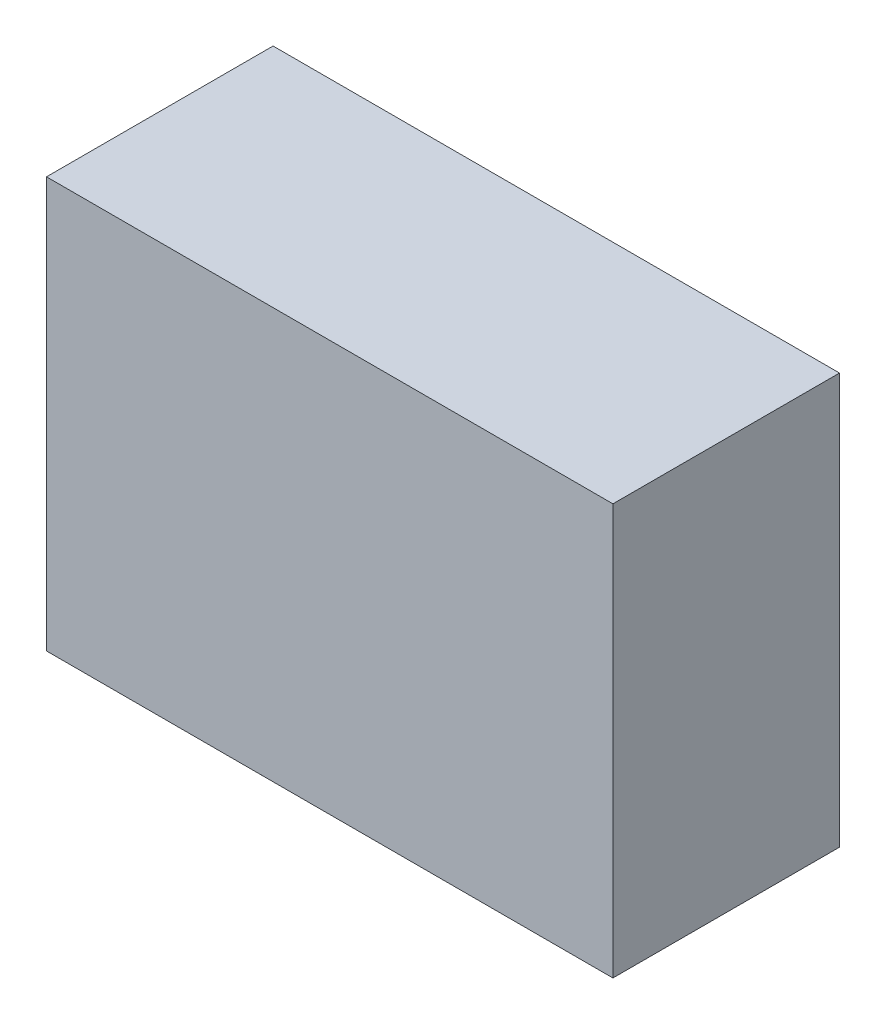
ISO-10303-21;
HEADER;
FILE_DESCRIPTION(('STEP AP214'),'2;1');
FILE_NAME('part.step','',(''),(''),'','','');
FILE_SCHEMA(('AUTOMOTIVE_DESIGN { 1 0 10303 214 1 1 1 1 }'));
ENDSEC;
DATA;
#1=APPLICATION_CONTEXT('core data for automotive mechanical design processes');
#2=APPLICATION_PROTOCOL_DEFINITION('international standard','automotive_design',2000,#1);
#3=PRODUCT_CONTEXT('',#1,'mechanical');
#4=PRODUCT('Part','Part','',(#3));
#5=PRODUCT_RELATED_PRODUCT_CATEGORY('part','',(#4));
#6=PRODUCT_DEFINITION_FORMATION('','',#4);
#7=PRODUCT_DEFINITION_CONTEXT('part definition',#1,'design');
#8=PRODUCT_DEFINITION('design','',#6,#7);
#9=PRODUCT_DEFINITION_SHAPE('','',#8);
#10=(LENGTH_UNIT() NAMED_UNIT(*) SI_UNIT(.MILLI.,.METRE.));
#11=(NAMED_UNIT(*) PLANE_ANGLE_UNIT() SI_UNIT($,.RADIAN.));
#12=(NAMED_UNIT(*) SI_UNIT($,.STERADIAN.) SOLID_ANGLE_UNIT());
#13=UNCERTAINTY_MEASURE_WITH_UNIT(LENGTH_MEASURE(1.E-05),#10,'distance_accuracy_value','');
#14=(GEOMETRIC_REPRESENTATION_CONTEXT(3) GLOBAL_UNCERTAINTY_ASSIGNED_CONTEXT((#13)) GLOBAL_UNIT_ASSIGNED_CONTEXT((#10,
#11,#12)) REPRESENTATION_CONTEXT('',''));
#15=CARTESIAN_POINT('',(0.,0.,0.));
#16=DIRECTION('',(0.,0.,1.));
#17=DIRECTION('',(1.,0.,0.));
#18=AXIS2_PLACEMENT_3D('',#15,#16,#17);
#19=CARTESIAN_POINT('',(0.,0.,8.));
#20=DIRECTION('',(1.,0.,0.));
#21=DIRECTION('',(0.,0.,-1.));
#22=AXIS2_PLACEMENT_3D('',#19,#20,#21);
#23=PLANE('',#22);
#24=DIRECTION('',(0.,-1.,0.));
#25=VECTOR('',#24,1.);
#26=CARTESIAN_POINT('',(0.,0.,0.));
#27=LINE('',#26,#25);
#28=CARTESIAN_POINT('',(0.,14.5,0.));
#29=VERTEX_POINT('',#28);
#30=CARTESIAN_POINT('',(0.,0.,0.));
#31=VERTEX_POINT('',#30);
#32=EDGE_CURVE('E94',#29,#31,#27,.T.);
#33=ORIENTED_EDGE('',*,*,#32,.T.);
#34=DIRECTION('',(0.,0.,-1.));
#35=VECTOR('',#34,1.);
#36=CARTESIAN_POINT('',(0.,0.,8.));
#37=LINE('',#36,#35);
#38=CARTESIAN_POINT('',(0.,0.,8.));
#39=VERTEX_POINT('',#38);
#40=EDGE_CURVE('E11',#39,#31,#37,.T.);
#41=ORIENTED_EDGE('',*,*,#40,.F.);
#42=DIRECTION('',(0.,-1.,0.));
#43=VECTOR('',#42,1.);
#44=CARTESIAN_POINT('',(0.,0.,8.));
#45=LINE('',#44,#43);
#46=CARTESIAN_POINT('',(0.,14.5,8.));
#47=VERTEX_POINT('',#46);
#48=EDGE_CURVE('E82',#47,#39,#45,.T.);
#49=ORIENTED_EDGE('',*,*,#48,.F.);
#50=DIRECTION('',(0.,0.,-1.));
#51=VECTOR('',#50,1.);
#52=CARTESIAN_POINT('',(0.,14.5,8.));
#53=LINE('',#52,#51);
#54=EDGE_CURVE('E90',#47,#29,#53,.T.);
#55=ORIENTED_EDGE('',*,*,#54,.T.);
#56=EDGE_LOOP('',(#33,#41,#49,#55));
#57=FACE_BOUND('',#56,.T.);
#58=ADVANCED_FACE('F31',(#57),#23,.F.);
#59=CARTESIAN_POINT('',(0.,0.,8.));
#60=DIRECTION('',(0.,1.,0.));
#61=DIRECTION('',(0.,0.,1.));
#62=AXIS2_PLACEMENT_3D('',#59,#60,#61);
#63=PLANE('',#62);
#64=DIRECTION('',(1.,0.,0.));
#65=VECTOR('',#64,1.);
#66=CARTESIAN_POINT('',(0.,0.,0.));
#67=LINE('',#66,#65);
#68=CARTESIAN_POINT('',(20.,0.,0.));
#69=VERTEX_POINT('',#68);
#70=EDGE_CURVE('E86',#31,#69,#67,.T.);
#71=ORIENTED_EDGE('',*,*,#70,.T.);
#72=DIRECTION('',(0.,0.,-1.));
#73=VECTOR('',#72,1.);
#74=CARTESIAN_POINT('',(20.,0.,8.));
#75=LINE('',#74,#73);
#76=CARTESIAN_POINT('',(20.,0.,8.));
#77=VERTEX_POINT('',#76);
#78=EDGE_CURVE('E39',#77,#69,#75,.T.);
#79=ORIENTED_EDGE('',*,*,#78,.F.);
#80=DIRECTION('',(1.,0.,0.));
#81=VECTOR('',#80,1.);
#82=CARTESIAN_POINT('',(0.,0.,8.));
#83=LINE('',#82,#81);
#84=EDGE_CURVE('E77',#39,#77,#83,.T.);
#85=ORIENTED_EDGE('',*,*,#84,.F.);
#86=ORIENTED_EDGE('',*,*,#40,.T.);
#87=EDGE_LOOP('',(#71,#79,#85,#86));
#88=FACE_BOUND('',#87,.T.);
#89=ADVANCED_FACE('F85',(#88),#63,.F.);
#90=CARTESIAN_POINT('',(20.,0.,8.));
#91=DIRECTION('',(-1.,0.,0.));
#92=DIRECTION('',(0.,0.,1.));
#93=AXIS2_PLACEMENT_3D('',#90,#91,#92);
#94=PLANE('',#93);
#95=DIRECTION('',(0.,1.,0.));
#96=VECTOR('',#95,1.);
#97=CARTESIAN_POINT('',(20.,0.,0.));
#98=LINE('',#97,#96);
#99=CARTESIAN_POINT('',(20.,14.5,0.));
#100=VERTEX_POINT('',#99);
#101=EDGE_CURVE('E64',#69,#100,#98,.T.);
#102=ORIENTED_EDGE('',*,*,#101,.T.);
#103=DIRECTION('',(0.,0.,-1.));
#104=VECTOR('',#103,1.);
#105=CARTESIAN_POINT('',(20.,14.5,8.));
#106=LINE('',#105,#104);
#107=CARTESIAN_POINT('',(20.,14.5,8.));
#108=VERTEX_POINT('',#107);
#109=EDGE_CURVE('E87',#108,#100,#106,.T.);
#110=ORIENTED_EDGE('',*,*,#109,.F.);
#111=DIRECTION('',(0.,1.,0.));
#112=VECTOR('',#111,1.);
#113=CARTESIAN_POINT('',(20.,0.,8.));
#114=LINE('',#113,#112);
#115=EDGE_CURVE('E80',#77,#108,#114,.T.);
#116=ORIENTED_EDGE('',*,*,#115,.F.);
#117=ORIENTED_EDGE('',*,*,#78,.T.);
#118=EDGE_LOOP('',(#102,#110,#116,#117));
#119=FACE_BOUND('',#118,.T.);
#120=ADVANCED_FACE('F88',(#119),#94,.F.);
#121=CARTESIAN_POINT('',(0.,14.5,8.));
#122=DIRECTION('',(0.,-1.,0.));
#123=DIRECTION('',(0.,0.,-1.));
#124=AXIS2_PLACEMENT_3D('',#121,#122,#123);
#125=PLANE('',#124);
#126=DIRECTION('',(-1.,0.,0.));
#127=VECTOR('',#126,1.);
#128=CARTESIAN_POINT('',(0.,14.5,0.));
#129=LINE('',#128,#127);
#130=EDGE_CURVE('E70',#100,#29,#129,.T.);
#131=ORIENTED_EDGE('',*,*,#130,.T.);
#132=ORIENTED_EDGE('',*,*,#54,.F.);
#133=DIRECTION('',(-1.,0.,0.));
#134=VECTOR('',#133,1.);
#135=CARTESIAN_POINT('',(0.,14.5,8.));
#136=LINE('',#135,#134);
#137=EDGE_CURVE('E47',#108,#47,#136,.T.);
#138=ORIENTED_EDGE('',*,*,#137,.F.);
#139=ORIENTED_EDGE('',*,*,#109,.T.);
#140=EDGE_LOOP('',(#131,#132,#138,#139));
#141=FACE_BOUND('',#140,.T.);
#142=ADVANCED_FACE('F101',(#141),#125,.F.);
#143=CARTESIAN_POINT('',(0.,14.5,8.));
#144=DIRECTION('',(0.,0.,-1.));
#145=DIRECTION('',(-1.,0.,0.));
#146=AXIS2_PLACEMENT_3D('',#143,#144,#145);
#147=PLANE('',#146);
#148=ORIENTED_EDGE('',*,*,#48,.T.);
#149=ORIENTED_EDGE('',*,*,#84,.T.);
#150=ORIENTED_EDGE('',*,*,#115,.T.);
#151=ORIENTED_EDGE('',*,*,#137,.T.);
#152=EDGE_LOOP('',(#148,#149,#150,#151));
#153=FACE_BOUND('',#152,.T.);
#154=ADVANCED_FACE('F78',(#153),#147,.F.);
#155=CARTESIAN_POINT('',(0.,14.5,0.));
#156=DIRECTION('',(0.,0.,-1.));
#157=DIRECTION('',(-1.,0.,0.));
#158=AXIS2_PLACEMENT_3D('',#155,#156,#157);
#159=PLANE('',#158);
#160=ORIENTED_EDGE('',*,*,#32,.F.);
#161=ORIENTED_EDGE('',*,*,#130,.F.);
#162=ORIENTED_EDGE('',*,*,#101,.F.);
#163=ORIENTED_EDGE('',*,*,#70,.F.);
#164=EDGE_LOOP('',(#160,#161,#162,#163));
#165=FACE_BOUND('',#164,.T.);
#166=ADVANCED_FACE('F104',(#165),#159,.T.);
#167=CLOSED_SHELL('',(#58,#89,#120,#142,#154,#166));
#168=MANIFOLD_SOLID_BREP('B2',#167);
#169=ADVANCED_BREP_SHAPE_REPRESENTATION('',(#18,#168),#14);
#170=SHAPE_DEFINITION_REPRESENTATION(#9,#169);
ENDSEC;
END-ISO-10303-21;
